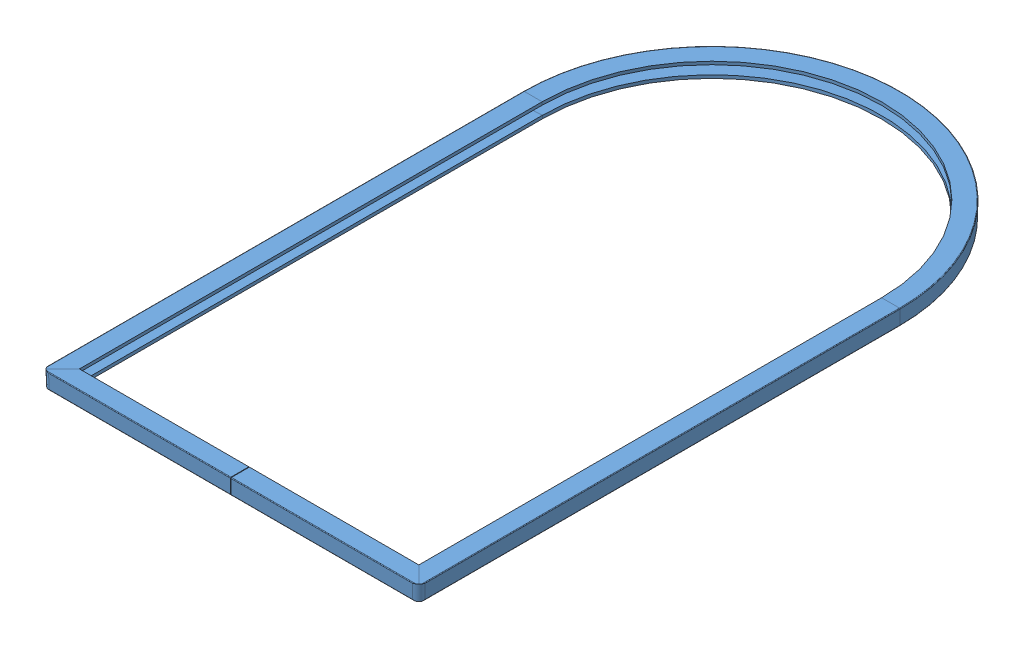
SolidWorks assembly Prototype v3 Assembly.SLDASM, configuration Default (file format 15000). Lengths in mm.
Overall size (194 141.33 344.71).
4 component instances, 3 part files, 9 mates.
Components (placement in the parent):
- Truss v3-1: Truss v3.SLDPRT [Default] at (98.2578 67.6284 16.773) size (130.18 127 28.58)
- Truss v3-2: Truss v3.SLDPRT [Default] at (190.3328 67.6284 181.6063) x (-1 0 0) z (0 0 -1) size (130.18 127 28.58)
- Platform v3-1: Platform v3.SLDPRT [Default] at (144.2953 194.6284 98.7705) x (-1 0 0) z (0 0 -1) size (190.5 5.46 341.31)
- rubber edge-1: rubber edge.SLDPRT [Default] at (169.8223 197.7707 218.5779) x (0 -0.999783 -0.020829) z (-1 0 0) size (15.23 344.46 194)
Mates (geometry in assembly coordinates):
- Concentric1: concentric anti-aligned: cylinder of Truss v3-2 through (85.5578 194.6284 194.3063) axis (0 -1 0) radius 1.905; circle of prototype_correct-vers_MK4(REVISED FRONT_UPDATED)-1
- Concentric2: concentric anti-aligned: cylinder of Truss v3-2 through (203.0328 194.6284 194.3063) axis (0 -1 0) radius 1.905; circle of prototype_correct-vers_MK4(REVISED FRONT_UPDATED)-1
- Distance1: distance = 1.55 mm aligned: plane of rubber edge-1 through (56.9521 201.6394 -24.2607) normal (0 1 0); plane of prototype_correct-vers_MK4(REVISED FRONT_UPDATED)-1 through (144.2953 200.0894 -24.2607) normal (0 1 0)
- Concentric8: concentric aligned: circle of prototype_correct-vers_MK4(REVISED FRONT_UPDATED)-1; circle of rubber edge-1
- Parallel5: parallel aligned: line of prototype_correct-vers_MK4(REVISED FRONT_UPDATED)-1 through (49.0453 200.0894 221.8018) axis (1 0 0); line of rubber edge-1 through (56.9521 201.6394 213.8949) axis (1 0 0)
- Coincident1: coincident anti-aligned: plane of Truss v3-2 through (85.5578 194.6284 194.3063) normal (0 1 0); plane of prototype_correct-vers_MK4(REVISED FRONT_UPDATED)-1 through (144.2953 194.6284 -24.2607) normal (0 -1 0)
- Concentric9: concentric aligned: circle of fillet truss v2 - UPDATED 4-5-23-1; circle of prototype_correct-vers_MK4(REVISED FRONT_UPDATED)-1
- Concentric10: concentric aligned: circle of fillet truss v2 - UPDATED 4-5-23-1; circle of prototype_correct-vers_MK4(REVISED FRONT_UPDATED)-1
- Coincident2: coincident anti-aligned: plane of fillet truss v2 - UPDATED 4-5-23-1 through (203.0328 194.6284 4.073) normal (0 1 0); plane of prototype_correct-vers_MK4(REVISED FRONT_UPDATED)-1 through (144.2953 194.6284 -24.2607) normal (0 -1 0)
